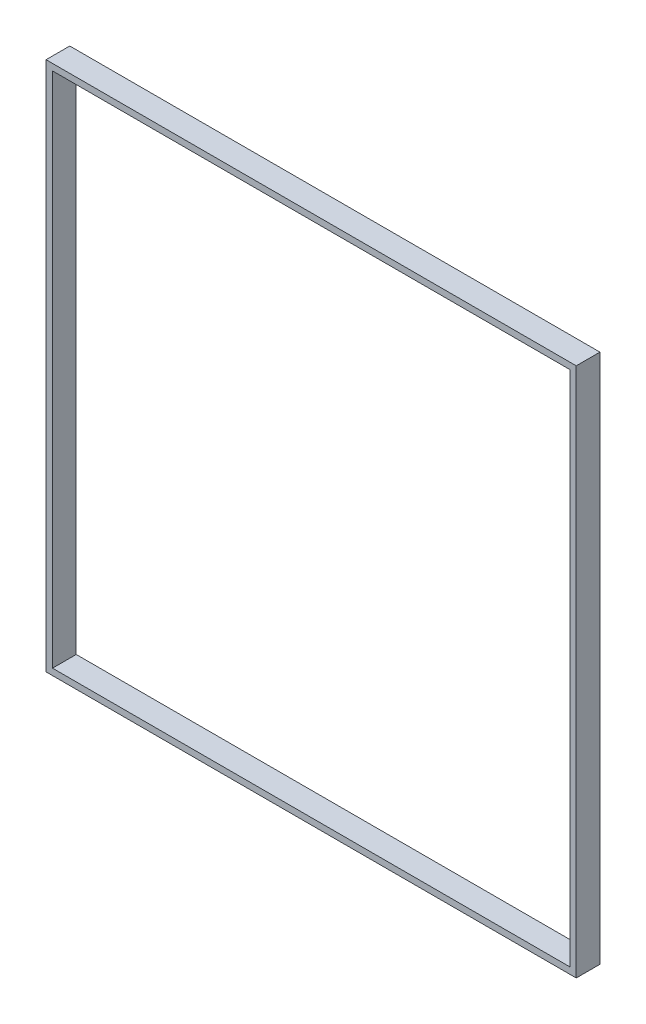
from build123d import *

# Parameters (mm, degrees)
SKETCH1_W      = 3124.2
SKETCH1_H      = 3124.2
SKETCH1_W_2    = 3048
SKETCH1_H_2    = 3048
EXTRUDE1_DEPTH = 139.7


with BuildPart() as part:
    # Sketch1 → Extrude1 (new body)
    with BuildSketch(Plane.XY):
        Rectangle(SKETCH1_W, SKETCH1_H)
        Rectangle(SKETCH1_W_2, SKETCH1_H_2, mode=Mode.SUBTRACT)
    extrude(amount=EXTRUDE1_DEPTH)


solid = part.part
